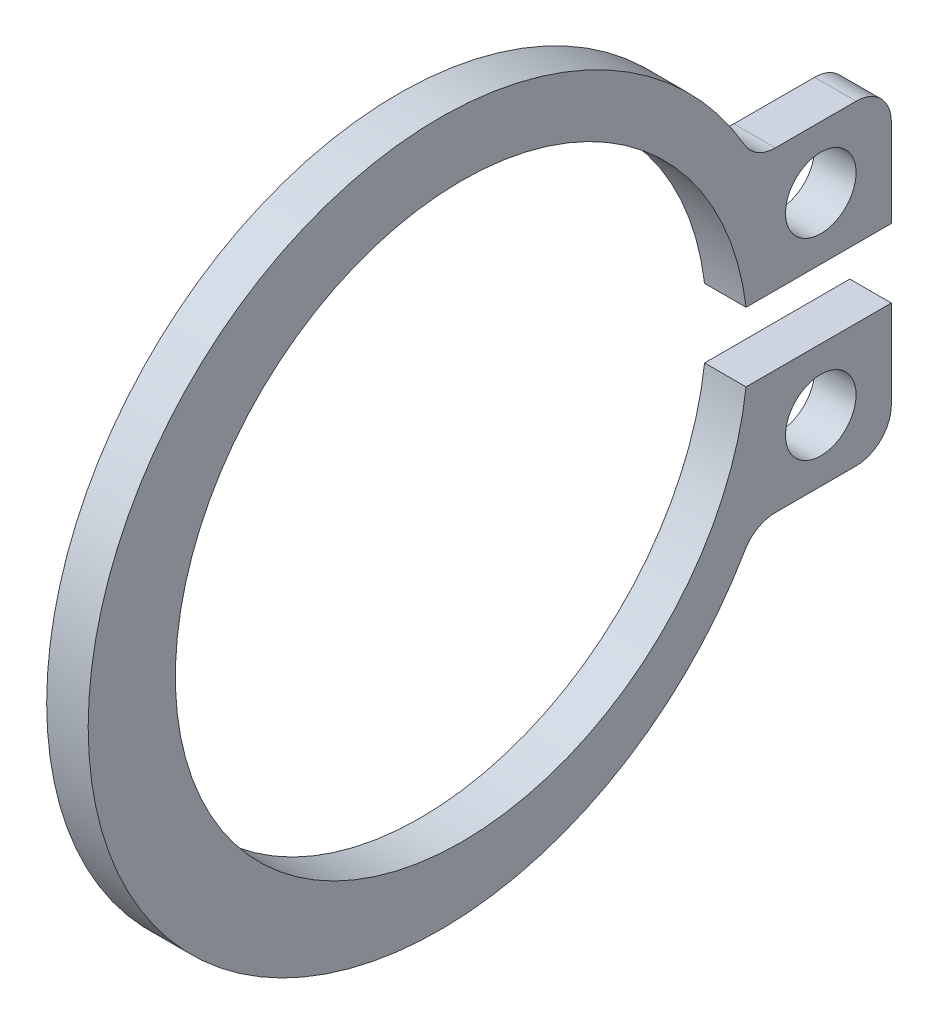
ISO-10303-21;
HEADER;
FILE_DESCRIPTION(('STEP AP214'),'2;1');
FILE_NAME('part.step','',(''),(''),'','','');
FILE_SCHEMA(('AUTOMOTIVE_DESIGN { 1 0 10303 214 1 1 1 1 }'));
ENDSEC;
DATA;
#1=APPLICATION_CONTEXT('core data for automotive mechanical design processes');
#2=APPLICATION_PROTOCOL_DEFINITION('international standard','automotive_design',2000,#1);
#3=PRODUCT_CONTEXT('',#1,'mechanical');
#4=PRODUCT('Part','Part','',(#3));
#5=PRODUCT_RELATED_PRODUCT_CATEGORY('part','',(#4));
#6=PRODUCT_DEFINITION_FORMATION('','',#4);
#7=PRODUCT_DEFINITION_CONTEXT('part definition',#1,'design');
#8=PRODUCT_DEFINITION('design','',#6,#7);
#9=PRODUCT_DEFINITION_SHAPE('','',#8);
#10=(LENGTH_UNIT() NAMED_UNIT(*) SI_UNIT(.MILLI.,.METRE.));
#11=(NAMED_UNIT(*) PLANE_ANGLE_UNIT() SI_UNIT($,.RADIAN.));
#12=(NAMED_UNIT(*) SI_UNIT($,.STERADIAN.) SOLID_ANGLE_UNIT());
#13=UNCERTAINTY_MEASURE_WITH_UNIT(LENGTH_MEASURE(1.E-05),#10,'distance_accuracy_value','');
#14=(GEOMETRIC_REPRESENTATION_CONTEXT(3) GLOBAL_UNCERTAINTY_ASSIGNED_CONTEXT((#13)) GLOBAL_UNIT_ASSIGNED_CONTEXT((#10,
#11,#12)) REPRESENTATION_CONTEXT('',''));
#15=CARTESIAN_POINT('',(0.,0.,0.));
#16=DIRECTION('',(0.,0.,1.));
#17=DIRECTION('',(1.,0.,0.));
#18=AXIS2_PLACEMENT_3D('',#15,#16,#17);
#19=CARTESIAN_POINT('',(0.,0.,0.));
#20=DIRECTION('',(1.,0.,0.));
#21=DIRECTION('',(0.,0.,-1.));
#22=AXIS2_PLACEMENT_3D('',#19,#20,#21);
#23=PLANE('',#22);
#24=CARTESIAN_POINT('',(0.,-2.3175,-8.64989780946));
#25=DIRECTION('',(1.,0.,0.));
#26=DIRECTION('',(0.,0.,-1.));
#27=AXIS2_PLACEMENT_3D('',#24,#25,#26);
#28=CIRCLE('',#27,0.85);
#29=CARTESIAN_POINT('',(0.,-2.3175,-9.49989780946));
#30=VERTEX_POINT('',#29);
#31=EDGE_CURVE('E174',#30,#30,#28,.T.);
#32=ORIENTED_EDGE('',*,*,#31,.T.);
#33=EDGE_LOOP('',(#32));
#34=FACE_BOUND('',#33,.T.);
#35=CARTESIAN_POINT('',(0.,2.3175,-8.64989780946));
#36=DIRECTION('',(1.,0.,0.));
#37=DIRECTION('',(0.,0.,-1.));
#38=AXIS2_PLACEMENT_3D('',#35,#36,#37);
#39=CIRCLE('',#38,0.85);
#40=CARTESIAN_POINT('',(0.,2.3175,-9.49989780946));
#41=VERTEX_POINT('',#40);
#42=EDGE_CURVE('E177',#41,#41,#39,.T.);
#43=ORIENTED_EDGE('',*,*,#42,.T.);
#44=EDGE_LOOP('',(#43));
#45=FACE_BOUND('',#44,.T.);
#46=CARTESIAN_POINT('',(0.,0.,0.));
#47=DIRECTION('',(1.,0.,0.));
#48=DIRECTION('',(0.,0.,-1.));
#49=AXIS2_PLACEMENT_3D('',#46,#47,#48);
#50=CIRCLE('',#49,6.9);
#51=CARTESIAN_POINT('',(0.,0.83,-6.84989780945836));
#52=VERTEX_POINT('',#51);
#53=CARTESIAN_POINT('',(0.,-0.829999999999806,-6.84989780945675));
#54=VERTEX_POINT('',#53);
#55=EDGE_CURVE('E180',#52,#54,#50,.T.);
#56=ORIENTED_EDGE('',*,*,#55,.T.);
#57=DIRECTION('',(0.,0.,-1.));
#58=VECTOR('',#57,1.);
#59=CARTESIAN_POINT('',(0.,-0.83,-6.84989780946));
#60=LINE('',#59,#58);
#61=CARTESIAN_POINT('',(0.,-0.83,-10.3498978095));
#62=VERTEX_POINT('',#61);
#63=EDGE_CURVE('E137',#54,#62,#60,.T.);
#64=ORIENTED_EDGE('',*,*,#63,.T.);
#65=DIRECTION('',(0.,1.,0.));
#66=VECTOR('',#65,1.);
#67=CARTESIAN_POINT('',(0.,0.83,-10.3498978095));
#68=LINE('',#67,#66);
#69=CARTESIAN_POINT('',(0.,-2.955,-10.3498978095));
#70=VERTEX_POINT('',#69);
#71=EDGE_CURVE('E141',#70,#62,#68,.T.);
#72=ORIENTED_EDGE('',*,*,#71,.F.);
#73=CARTESIAN_POINT('',(0.,-2.955,-9.49989780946));
#74=DIRECTION('',(1.,0.,0.));
#75=DIRECTION('',(0.,0.,-1.));
#76=AXIS2_PLACEMENT_3D('',#73,#74,#75);
#77=CIRCLE('',#76,0.85);
#78=CARTESIAN_POINT('',(0.,-3.805,-9.49989780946));
#79=VERTEX_POINT('',#78);
#80=EDGE_CURVE('E183',#79,#70,#77,.T.);
#81=ORIENTED_EDGE('',*,*,#80,.F.);
#82=DIRECTION('',(0.,0.,-1.));
#83=VECTOR('',#82,1.);
#84=CARTESIAN_POINT('',(0.,-3.805,-7.55501237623));
#85=LINE('',#84,#83);
#86=CARTESIAN_POINT('',(0.,-3.805,-7.55501237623));
#87=VERTEX_POINT('',#86);
#88=EDGE_CURVE('E149',#87,#79,#85,.T.);
#89=ORIENTED_EDGE('',*,*,#88,.F.);
#90=CARTESIAN_POINT('',(0.,-4.655,-7.55501237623));
#91=DIRECTION('',(1.,0.,0.));
#92=DIRECTION('',(0.,0.,-1.));
#93=AXIS2_PLACEMENT_3D('',#90,#91,#92);
#94=CIRCLE('',#93,0.85);
#95=CARTESIAN_POINT('',(0.,-4.23068364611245,-6.81849650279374));
#96=VERTEX_POINT('',#95);
#97=EDGE_CURVE('E185',#87,#96,#94,.T.);
#98=ORIENTED_EDGE('',*,*,#97,.T.);
#99=CARTESIAN_POINT('',(0.,0.,0.525));
#100=DIRECTION('',(1.,0.,0.));
#101=DIRECTION('',(0.,0.,-1.));
#102=AXIS2_PLACEMENT_3D('',#99,#100,#101);
#103=CIRCLE('',#102,8.475);
#104=CARTESIAN_POINT('',(0.,4.23068364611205,-6.81849650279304));
#105=VERTEX_POINT('',#104);
#106=EDGE_CURVE('E188',#105,#96,#103,.T.);
#107=ORIENTED_EDGE('',*,*,#106,.F.);
#108=CARTESIAN_POINT('',(0.,4.655,-7.55501237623));
#109=DIRECTION('',(1.,0.,0.));
#110=DIRECTION('',(0.,0.,-1.));
#111=AXIS2_PLACEMENT_3D('',#108,#109,#110);
#112=CIRCLE('',#111,0.85);
#113=CARTESIAN_POINT('',(0.,3.805,-7.55501237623));
#114=VERTEX_POINT('',#113);
#115=EDGE_CURVE('E106',#105,#114,#112,.T.);
#116=ORIENTED_EDGE('',*,*,#115,.T.);
#117=DIRECTION('',(0.,0.,-1.));
#118=VECTOR('',#117,1.);
#119=CARTESIAN_POINT('',(0.,3.805,-7.55501237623));
#120=LINE('',#119,#118);
#121=CARTESIAN_POINT('',(0.,3.805,-9.49989780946));
#122=VERTEX_POINT('',#121);
#123=EDGE_CURVE('E102',#114,#122,#120,.T.);
#124=ORIENTED_EDGE('',*,*,#123,.T.);
#125=CARTESIAN_POINT('',(0.,2.955,-9.49989780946));
#126=DIRECTION('',(1.,0.,0.));
#127=DIRECTION('',(0.,0.,-1.));
#128=AXIS2_PLACEMENT_3D('',#125,#126,#127);
#129=CIRCLE('',#128,0.85);
#130=CARTESIAN_POINT('',(0.,2.955,-10.34989780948));
#131=VERTEX_POINT('',#130);
#132=EDGE_CURVE('E19',#131,#122,#129,.T.);
#133=ORIENTED_EDGE('',*,*,#132,.F.);
#134=DIRECTION('',(0.,1.,0.));
#135=VECTOR('',#134,1.);
#136=CARTESIAN_POINT('',(0.,0.83,-10.3498978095));
#137=LINE('',#136,#135);
#138=CARTESIAN_POINT('',(0.,0.83,-10.3498978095));
#139=VERTEX_POINT('',#138);
#140=EDGE_CURVE('E97',#139,#131,#137,.T.);
#141=ORIENTED_EDGE('',*,*,#140,.F.);
#142=DIRECTION('',(0.,0.,-1.));
#143=VECTOR('',#142,1.);
#144=CARTESIAN_POINT('',(0.,0.83,-6.84989780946));
#145=LINE('',#144,#143);
#146=EDGE_CURVE('E130',#52,#139,#145,.T.);
#147=ORIENTED_EDGE('',*,*,#146,.F.);
#148=EDGE_LOOP('',(#56,#64,#72,#81,#89,#98,#107,#116,#124,#133,#141,#147));
#149=FACE_BOUND('',#148,.T.);
#150=ADVANCED_FACE('F16',(#34,#45,#149),#23,.F.);
#151=CARTESIAN_POINT('',(0.,0.83,-10.3498978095));
#152=DIRECTION('',(0.,0.,-1.));
#153=DIRECTION('',(-1.,0.,0.));
#154=AXIS2_PLACEMENT_3D('',#151,#152,#153);
#155=PLANE('',#154);
#156=DIRECTION('',(1.,0.,0.));
#157=VECTOR('',#156,1.);
#158=CARTESIAN_POINT('',(0.5,2.955,-10.34989780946));
#159=LINE('',#158,#157);
#160=CARTESIAN_POINT('',(1.,2.955,-10.34989780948));
#161=VERTEX_POINT('',#160);
#162=EDGE_CURVE('E116',#161,#131,#159,.F.);
#163=ORIENTED_EDGE('',*,*,#162,.F.);
#164=DIRECTION('',(0.,1.,0.));
#165=VECTOR('',#164,1.);
#166=CARTESIAN_POINT('',(1.,0.,-10.3498978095));
#167=LINE('',#166,#165);
#168=CARTESIAN_POINT('',(1.,0.83,-10.3498978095));
#169=VERTEX_POINT('',#168);
#170=EDGE_CURVE('E173',#169,#161,#167,.T.);
#171=ORIENTED_EDGE('',*,*,#170,.F.);
#172=DIRECTION('',(1.,0.,0.));
#173=VECTOR('',#172,1.);
#174=CARTESIAN_POINT('',(0.,0.83,-10.3498978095));
#175=LINE('',#174,#173);
#176=EDGE_CURVE('E133',#139,#169,#175,.T.);
#177=ORIENTED_EDGE('',*,*,#176,.F.);
#178=ORIENTED_EDGE('',*,*,#140,.T.);
#179=EDGE_LOOP('',(#163,#171,#177,#178));
#180=FACE_BOUND('',#179,.T.);
#181=ADVANCED_FACE('F238',(#180),#155,.T.);
#182=CARTESIAN_POINT('',(0.5,2.955,-9.49989780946));
#183=DIRECTION('',(1.,0.,0.));
#184=DIRECTION('',(0.,0.,-1.));
#185=AXIS2_PLACEMENT_3D('',#182,#183,#184);
#186=CYLINDRICAL_SURFACE('',#185,0.85);
#187=DIRECTION('',(1.,0.,0.));
#188=VECTOR('',#187,1.);
#189=CARTESIAN_POINT('',(0.,3.805,-9.49989780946));
#190=LINE('',#189,#188);
#191=CARTESIAN_POINT('',(1.,3.805,-9.49989780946));
#192=VERTEX_POINT('',#191);
#193=EDGE_CURVE('E110',#122,#192,#190,.T.);
#194=ORIENTED_EDGE('',*,*,#193,.T.);
#195=CARTESIAN_POINT('',(1.,2.955,-9.49989780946));
#196=DIRECTION('',(1.,0.,0.));
#197=DIRECTION('',(0.,0.,-1.));
#198=AXIS2_PLACEMENT_3D('',#195,#196,#197);
#199=CIRCLE('',#198,0.85);
#200=EDGE_CURVE('E171',#161,#192,#199,.T.);
#201=ORIENTED_EDGE('',*,*,#200,.F.);
#202=ORIENTED_EDGE('',*,*,#162,.T.);
#203=ORIENTED_EDGE('',*,*,#132,.T.);
#204=EDGE_LOOP('',(#194,#201,#202,#203));
#205=FACE_BOUND('',#204,.T.);
#206=ADVANCED_FACE('F113',(#205),#186,.T.);
#207=CARTESIAN_POINT('',(0.,3.805,-7.55501237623));
#208=DIRECTION('',(0.,-1.,0.));
#209=DIRECTION('',(0.,0.,-1.));
#210=AXIS2_PLACEMENT_3D('',#207,#208,#209);
#211=PLANE('',#210);
#212=ORIENTED_EDGE('',*,*,#123,.F.);
#213=DIRECTION('',(1.,0.,0.));
#214=VECTOR('',#213,1.);
#215=CARTESIAN_POINT('',(0.5,3.805,-7.55501237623));
#216=LINE('',#215,#214);
#217=CARTESIAN_POINT('',(1.,3.805,-7.55501237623));
#218=VERTEX_POINT('',#217);
#219=EDGE_CURVE('E122',#114,#218,#216,.T.);
#220=ORIENTED_EDGE('',*,*,#219,.T.);
#221=DIRECTION('',(0.,0.,-1.));
#222=VECTOR('',#221,1.);
#223=CARTESIAN_POINT('',(1.,3.805,0.));
#224=LINE('',#223,#222);
#225=EDGE_CURVE('E119',#192,#218,#224,.F.);
#226=ORIENTED_EDGE('',*,*,#225,.F.);
#227=ORIENTED_EDGE('',*,*,#193,.F.);
#228=EDGE_LOOP('',(#212,#220,#226,#227));
#229=FACE_BOUND('',#228,.T.);
#230=ADVANCED_FACE('F117',(#229),#211,.F.);
#231=CARTESIAN_POINT('',(0.5,4.655,-7.55501237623));
#232=DIRECTION('',(1.,0.,0.));
#233=DIRECTION('',(0.,0.,-1.));
#234=AXIS2_PLACEMENT_3D('',#231,#232,#233);
#235=CYLINDRICAL_SURFACE('',#234,0.85);
#236=ORIENTED_EDGE('',*,*,#115,.F.);
#237=DIRECTION('',(1.,0.,0.));
#238=VECTOR('',#237,1.);
#239=CARTESIAN_POINT('',(0.5,4.23068364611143,-6.81849650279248));
#240=LINE('',#239,#238);
#241=CARTESIAN_POINT('',(1.,4.23068364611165,-6.81849650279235));
#242=VERTEX_POINT('',#241);
#243=EDGE_CURVE('E190',#242,#105,#240,.F.);
#244=ORIENTED_EDGE('',*,*,#243,.F.);
#245=CARTESIAN_POINT('',(1.,4.655,-7.55501237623));
#246=DIRECTION('',(1.,0.,0.));
#247=DIRECTION('',(0.,0.,-1.));
#248=AXIS2_PLACEMENT_3D('',#245,#246,#247);
#249=CIRCLE('',#248,0.85);
#250=EDGE_CURVE('E168',#218,#242,#249,.F.);
#251=ORIENTED_EDGE('',*,*,#250,.F.);
#252=ORIENTED_EDGE('',*,*,#219,.F.);
#253=EDGE_LOOP('',(#236,#244,#251,#252));
#254=FACE_BOUND('',#253,.T.);
#255=ADVANCED_FACE('F264',(#254),#235,.F.);
#256=CARTESIAN_POINT('',(0.5,0.,0.525));
#257=DIRECTION('',(1.,0.,0.));
#258=DIRECTION('',(0.,0.,-1.));
#259=AXIS2_PLACEMENT_3D('',#256,#257,#258);
#260=CYLINDRICAL_SURFACE('',#259,8.475);
#261=DIRECTION('',(1.,0.,0.));
#262=VECTOR('',#261,1.);
#263=CARTESIAN_POINT('',(0.5,-4.23068364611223,-6.81849650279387));
#264=LINE('',#263,#262);
#265=CARTESIAN_POINT('',(1.,-4.23068364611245,-6.81849650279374));
#266=VERTEX_POINT('',#265);
#267=EDGE_CURVE('E187',#96,#266,#264,.T.);
#268=ORIENTED_EDGE('',*,*,#267,.T.);
#269=CARTESIAN_POINT('',(1.,0.,0.525));
#270=DIRECTION('',(1.,0.,0.));
#271=DIRECTION('',(0.,0.,-1.));
#272=AXIS2_PLACEMENT_3D('',#269,#270,#271);
#273=CIRCLE('',#272,8.475);
#274=EDGE_CURVE('E166',#242,#266,#273,.T.);
#275=ORIENTED_EDGE('',*,*,#274,.F.);
#276=ORIENTED_EDGE('',*,*,#243,.T.);
#277=ORIENTED_EDGE('',*,*,#106,.T.);
#278=EDGE_LOOP('',(#268,#275,#276,#277));
#279=FACE_BOUND('',#278,.T.);
#280=ADVANCED_FACE('F266',(#279),#260,.T.);
#281=CARTESIAN_POINT('',(0.5,-4.655,-7.55501237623));
#282=DIRECTION('',(1.,0.,0.));
#283=DIRECTION('',(0.,0.,-1.));
#284=AXIS2_PLACEMENT_3D('',#281,#282,#283);
#285=CYLINDRICAL_SURFACE('',#284,0.85);
#286=ORIENTED_EDGE('',*,*,#97,.F.);
#287=DIRECTION('',(1.,0.,0.));
#288=VECTOR('',#287,1.);
#289=CARTESIAN_POINT('',(0.,-3.805,-7.55501237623));
#290=LINE('',#289,#288);
#291=CARTESIAN_POINT('',(1.,-3.805,-7.55501237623));
#292=VERTEX_POINT('',#291);
#293=EDGE_CURVE('E151',#292,#87,#290,.F.);
#294=ORIENTED_EDGE('',*,*,#293,.F.);
#295=CARTESIAN_POINT('',(1.,-4.655,-7.55501237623));
#296=DIRECTION('',(1.,0.,0.));
#297=DIRECTION('',(0.,0.,-1.));
#298=AXIS2_PLACEMENT_3D('',#295,#296,#297);
#299=CIRCLE('',#298,0.85);
#300=EDGE_CURVE('E163',#266,#292,#299,.F.);
#301=ORIENTED_EDGE('',*,*,#300,.F.);
#302=ORIENTED_EDGE('',*,*,#267,.F.);
#303=EDGE_LOOP('',(#286,#294,#301,#302));
#304=FACE_BOUND('',#303,.T.);
#305=ADVANCED_FACE('F262',(#304),#285,.F.);
#306=CARTESIAN_POINT('',(0.,-3.805,-7.55501237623));
#307=DIRECTION('',(0.,-1.,0.));
#308=DIRECTION('',(0.,0.,-1.));
#309=AXIS2_PLACEMENT_3D('',#306,#307,#308);
#310=PLANE('',#309);
#311=DIRECTION('',(1.,0.,0.));
#312=VECTOR('',#311,1.);
#313=CARTESIAN_POINT('',(0.5,-3.805,-9.49989780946));
#314=LINE('',#313,#312);
#315=CARTESIAN_POINT('',(1.,-3.805,-9.49989780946));
#316=VERTEX_POINT('',#315);
#317=EDGE_CURVE('E150',#316,#79,#314,.F.);
#318=ORIENTED_EDGE('',*,*,#317,.F.);
#319=DIRECTION('',(0.,0.,-1.));
#320=VECTOR('',#319,1.);
#321=CARTESIAN_POINT('',(1.,-3.805,0.));
#322=LINE('',#321,#320);
#323=EDGE_CURVE('E162',#292,#316,#322,.T.);
#324=ORIENTED_EDGE('',*,*,#323,.F.);
#325=ORIENTED_EDGE('',*,*,#293,.T.);
#326=ORIENTED_EDGE('',*,*,#88,.T.);
#327=EDGE_LOOP('',(#318,#324,#325,#326));
#328=FACE_BOUND('',#327,.T.);
#329=ADVANCED_FACE('F259',(#328),#310,.T.);
#330=CARTESIAN_POINT('',(0.5,-2.955,-9.49989780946));
#331=DIRECTION('',(1.,0.,0.));
#332=DIRECTION('',(0.,0.,-1.));
#333=AXIS2_PLACEMENT_3D('',#330,#331,#332);
#334=CYLINDRICAL_SURFACE('',#333,0.85);
#335=DIRECTION('',(-1.,0.,0.));
#336=VECTOR('',#335,1.);
#337=CARTESIAN_POINT('',(0.,-2.955,-10.3498978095));
#338=LINE('',#337,#336);
#339=CARTESIAN_POINT('',(1.,-2.955,-10.3498978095));
#340=VERTEX_POINT('',#339);
#341=EDGE_CURVE('E146',#340,#70,#338,.T.);
#342=ORIENTED_EDGE('',*,*,#341,.F.);
#343=CARTESIAN_POINT('',(1.,-2.955,-9.49989780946));
#344=DIRECTION('',(1.,0.,0.));
#345=DIRECTION('',(0.,0.,-1.));
#346=AXIS2_PLACEMENT_3D('',#343,#344,#345);
#347=CIRCLE('',#346,0.85);
#348=EDGE_CURVE('E158',#316,#340,#347,.T.);
#349=ORIENTED_EDGE('',*,*,#348,.F.);
#350=ORIENTED_EDGE('',*,*,#317,.T.);
#351=ORIENTED_EDGE('',*,*,#80,.T.);
#352=EDGE_LOOP('',(#342,#349,#350,#351));
#353=FACE_BOUND('',#352,.T.);
#354=ADVANCED_FACE('F256',(#353),#334,.T.);
#355=CARTESIAN_POINT('',(0.,0.83,-10.3498978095));
#356=DIRECTION('',(0.,0.,-1.));
#357=DIRECTION('',(-1.,0.,0.));
#358=AXIS2_PLACEMENT_3D('',#355,#356,#357);
#359=PLANE('',#358);
#360=DIRECTION('',(1.,0.,0.));
#361=VECTOR('',#360,1.);
#362=CARTESIAN_POINT('',(0.,-0.83,-10.3498978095));
#363=LINE('',#362,#361);
#364=CARTESIAN_POINT('',(1.,-0.83,-10.3498978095));
#365=VERTEX_POINT('',#364);
#366=EDGE_CURVE('E140',#62,#365,#363,.T.);
#367=ORIENTED_EDGE('',*,*,#366,.T.);
#368=DIRECTION('',(0.,1.,0.));
#369=VECTOR('',#368,1.);
#370=CARTESIAN_POINT('',(1.,0.,-10.3498978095));
#371=LINE('',#370,#369);
#372=EDGE_CURVE('E161',#340,#365,#371,.T.);
#373=ORIENTED_EDGE('',*,*,#372,.F.);
#374=ORIENTED_EDGE('',*,*,#341,.T.);
#375=ORIENTED_EDGE('',*,*,#71,.T.);
#376=EDGE_LOOP('',(#367,#373,#374,#375));
#377=FACE_BOUND('',#376,.T.);
#378=ADVANCED_FACE('F251',(#377),#359,.T.);
#379=CARTESIAN_POINT('',(0.,-0.83,-6.84989780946));
#380=DIRECTION('',(0.,-1.,0.));
#381=DIRECTION('',(0.,0.,-1.));
#382=AXIS2_PLACEMENT_3D('',#379,#380,#381);
#383=PLANE('',#382);
#384=ORIENTED_EDGE('',*,*,#63,.F.);
#385=DIRECTION('',(1.,0.,0.));
#386=VECTOR('',#385,1.);
#387=CARTESIAN_POINT('',(0.5,-0.829999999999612,-6.84989780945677));
#388=LINE('',#387,#386);
#389=CARTESIAN_POINT('',(1.,-0.829999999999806,-6.84989780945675));
#390=VERTEX_POINT('',#389);
#391=EDGE_CURVE('E182',#54,#390,#388,.T.);
#392=ORIENTED_EDGE('',*,*,#391,.T.);
#393=DIRECTION('',(0.,0.,-1.));
#394=VECTOR('',#393,1.);
#395=CARTESIAN_POINT('',(1.,-0.83,0.));
#396=LINE('',#395,#394);
#397=EDGE_CURVE('E157',#365,#390,#396,.F.);
#398=ORIENTED_EDGE('',*,*,#397,.F.);
#399=ORIENTED_EDGE('',*,*,#366,.F.);
#400=EDGE_LOOP('',(#384,#392,#398,#399));
#401=FACE_BOUND('',#400,.T.);
#402=ADVANCED_FACE('F245',(#401),#383,.F.);
#403=CARTESIAN_POINT('',(0.5,0.,0.));
#404=DIRECTION('',(1.,0.,0.));
#405=DIRECTION('',(0.,0.,-1.));
#406=AXIS2_PLACEMENT_3D('',#403,#404,#405);
#407=CYLINDRICAL_SURFACE('',#406,6.9);
#408=ORIENTED_EDGE('',*,*,#55,.F.);
#409=DIRECTION('',(1.,0.,0.));
#410=VECTOR('',#409,1.);
#411=CARTESIAN_POINT('',(0.,0.83,-6.84989780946));
#412=LINE('',#411,#410);
#413=CARTESIAN_POINT('',(1.,0.83,-6.84989780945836));
#414=VERTEX_POINT('',#413);
#415=EDGE_CURVE('E134',#414,#52,#412,.F.);
#416=ORIENTED_EDGE('',*,*,#415,.F.);
#417=CARTESIAN_POINT('',(1.,0.,0.));
#418=DIRECTION('',(1.,0.,0.));
#419=DIRECTION('',(0.,0.,-1.));
#420=AXIS2_PLACEMENT_3D('',#417,#418,#419);
#421=CIRCLE('',#420,6.9);
#422=EDGE_CURVE('E34',#390,#414,#421,.F.);
#423=ORIENTED_EDGE('',*,*,#422,.F.);
#424=ORIENTED_EDGE('',*,*,#391,.F.);
#425=EDGE_LOOP('',(#408,#416,#423,#424));
#426=FACE_BOUND('',#425,.T.);
#427=ADVANCED_FACE('F247',(#426),#407,.F.);
#428=CARTESIAN_POINT('',(0.,0.83,-6.84989780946));
#429=DIRECTION('',(0.,-1.,0.));
#430=DIRECTION('',(0.,0.,-1.));
#431=AXIS2_PLACEMENT_3D('',#428,#429,#430);
#432=PLANE('',#431);
#433=ORIENTED_EDGE('',*,*,#176,.T.);
#434=DIRECTION('',(0.,0.,-1.));
#435=VECTOR('',#434,1.);
#436=CARTESIAN_POINT('',(1.,0.83,0.));
#437=LINE('',#436,#435);
#438=EDGE_CURVE('E155',#414,#169,#437,.T.);
#439=ORIENTED_EDGE('',*,*,#438,.F.);
#440=ORIENTED_EDGE('',*,*,#415,.T.);
#441=ORIENTED_EDGE('',*,*,#146,.T.);
#442=EDGE_LOOP('',(#433,#439,#440,#441));
#443=FACE_BOUND('',#442,.T.);
#444=ADVANCED_FACE('F236',(#443),#432,.T.);
#445=CARTESIAN_POINT('',(0.5,2.3175,-8.64989780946));
#446=DIRECTION('',(1.,0.,0.));
#447=DIRECTION('',(0.,0.,-1.));
#448=AXIS2_PLACEMENT_3D('',#445,#446,#447);
#449=CYLINDRICAL_SURFACE('',#448,0.85);
#450=ORIENTED_EDGE('',*,*,#42,.F.);
#451=EDGE_LOOP('',(#450));
#452=FACE_BOUND('',#451,.T.);
#453=CARTESIAN_POINT('',(1.,2.3175,-8.64989780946));
#454=DIRECTION('',(1.,0.,0.));
#455=DIRECTION('',(0.,0.,-1.));
#456=AXIS2_PLACEMENT_3D('',#453,#454,#455);
#457=CIRCLE('',#456,0.85);
#458=CARTESIAN_POINT('',(1.,2.3175,-9.49989780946));
#459=VERTEX_POINT('',#458);
#460=EDGE_CURVE('E25',#459,#459,#457,.F.);
#461=ORIENTED_EDGE('',*,*,#460,.F.);
#462=EDGE_LOOP('',(#461));
#463=FACE_BOUND('',#462,.T.);
#464=ADVANCED_FACE('F283',(#452,#463),#449,.F.);
#465=CARTESIAN_POINT('',(0.5,-2.3175,-8.64989780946));
#466=DIRECTION('',(1.,0.,0.));
#467=DIRECTION('',(0.,0.,-1.));
#468=AXIS2_PLACEMENT_3D('',#465,#466,#467);
#469=CYLINDRICAL_SURFACE('',#468,0.85);
#470=ORIENTED_EDGE('',*,*,#31,.F.);
#471=EDGE_LOOP('',(#470));
#472=FACE_BOUND('',#471,.T.);
#473=CARTESIAN_POINT('',(1.,-2.3175,-8.64989780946));
#474=DIRECTION('',(1.,0.,0.));
#475=DIRECTION('',(0.,0.,-1.));
#476=AXIS2_PLACEMENT_3D('',#473,#474,#475);
#477=CIRCLE('',#476,0.85);
#478=CARTESIAN_POINT('',(1.,-2.3175,-9.49989780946));
#479=VERTEX_POINT('',#478);
#480=EDGE_CURVE('E11',#479,#479,#477,.F.);
#481=ORIENTED_EDGE('',*,*,#480,.F.);
#482=EDGE_LOOP('',(#481));
#483=FACE_BOUND('',#482,.T.);
#484=ADVANCED_FACE('F277',(#472,#483),#469,.F.);
#485=CARTESIAN_POINT('',(1.,0.,0.));
#486=DIRECTION('',(1.,0.,0.));
#487=DIRECTION('',(0.,0.,-1.));
#488=AXIS2_PLACEMENT_3D('',#485,#486,#487);
#489=PLANE('',#488);
#490=ORIENTED_EDGE('',*,*,#480,.T.);
#491=EDGE_LOOP('',(#490));
#492=FACE_BOUND('',#491,.T.);
#493=ORIENTED_EDGE('',*,*,#460,.T.);
#494=EDGE_LOOP('',(#493));
#495=FACE_BOUND('',#494,.T.);
#496=ORIENTED_EDGE('',*,*,#422,.T.);
#497=ORIENTED_EDGE('',*,*,#438,.T.);
#498=ORIENTED_EDGE('',*,*,#170,.T.);
#499=ORIENTED_EDGE('',*,*,#200,.T.);
#500=ORIENTED_EDGE('',*,*,#225,.T.);
#501=ORIENTED_EDGE('',*,*,#250,.T.);
#502=ORIENTED_EDGE('',*,*,#274,.T.);
#503=ORIENTED_EDGE('',*,*,#300,.T.);
#504=ORIENTED_EDGE('',*,*,#323,.T.);
#505=ORIENTED_EDGE('',*,*,#348,.T.);
#506=ORIENTED_EDGE('',*,*,#372,.T.);
#507=ORIENTED_EDGE('',*,*,#397,.T.);
#508=EDGE_LOOP('',(#496,#497,#498,#499,#500,#501,#502,#503,#504,#505,#506,#507));
#509=FACE_BOUND('',#508,.T.);
#510=ADVANCED_FACE('F232',(#492,#495,#509),#489,.T.);
#511=CLOSED_SHELL('',(#150,#181,#206,#230,#255,#280,#305,#329,#354,#378,#402,#427,#444,#464,
#484,#510));
#512=MANIFOLD_SOLID_BREP('B1',#511);
#513=ADVANCED_BREP_SHAPE_REPRESENTATION('',(#18,#512),#14);
#514=SHAPE_DEFINITION_REPRESENTATION(#9,#513);
ENDSEC;
END-ISO-10303-21;
